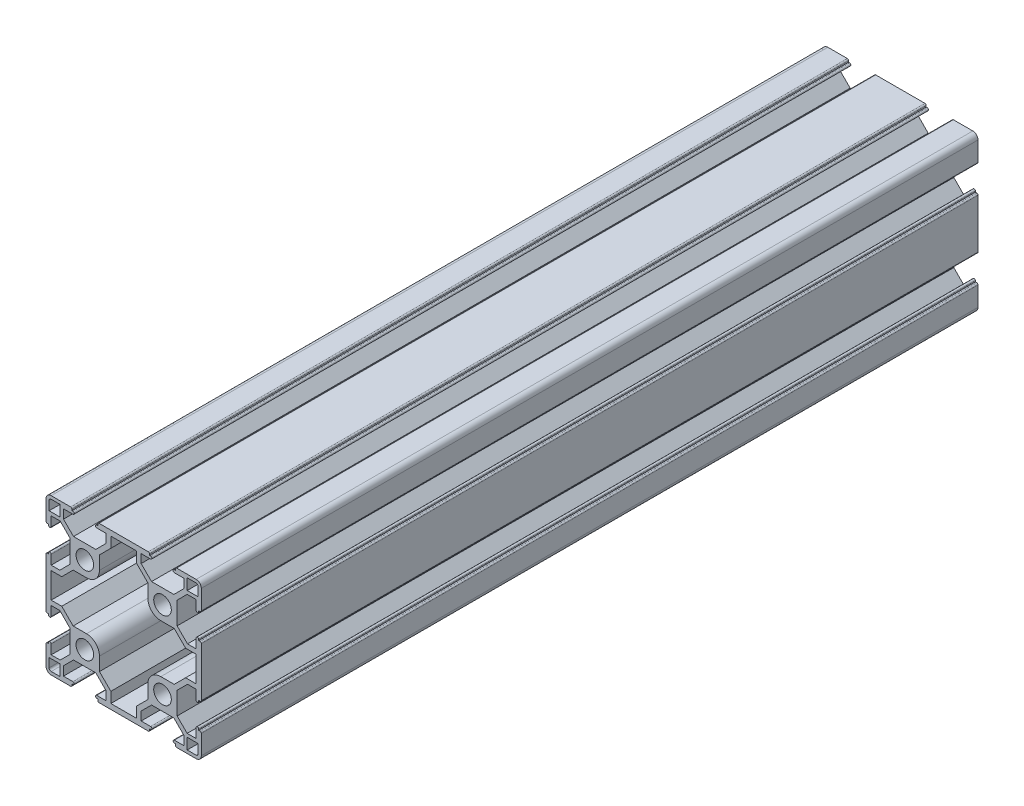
from build123d import *

# Parameters (mm, degrees)
MODEL_R         = 3.4
EXTRUDE_1_DEPTH = 300


with BuildPart() as part:
    # Model → Extrude 1 (new body)
    with BuildSketch(Plane.XY):
        with BuildLine():
            Line((27670.237038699, -9671.285265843), (27670.737038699, -9671.285265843))
            ThreePointArc((27670.737038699, -9671.285265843), (27671.09059209, -9671.138819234), (27671.237038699, -9670.785265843))
            Line((27671.237038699, -9670.785265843), (27671.237038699, -9651.785265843))
            ThreePointArc((27671.237038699, -9651.785265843), (27671.09059209, -9651.431712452), (27670.737038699, -9651.285265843))
            Line((27670.737038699, -9651.285265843), (27670.237038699, -9651.285265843))
            Line((27670.237038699, -9651.285265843), (27670.237038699, -9650.885265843))
            ThreePointArc((27670.237038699, -9650.885265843), (27670.09059209, -9650.531712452), (27669.737038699, -9650.385265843))
            ThreePointArc((27669.737038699, -9650.385265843), (27669.383485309, -9650.531712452), (27669.237038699, -9650.885265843))
            Line((27669.237038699, -9650.885265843), (27669.237038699, -9654.535265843))
            Line((27669.237038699, -9654.535265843), (27665.901252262, -9654.535265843))
            Line((27665.901252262, -9654.535265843), (27661.887038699, -9650.521052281))
            Line((27661.887038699, -9650.521052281), (27661.887038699, -9641.908058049))
            Line((27661.887038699, -9641.908058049), (27665.759830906, -9638.035265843))
            Line((27665.759830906, -9638.035265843), (27669.237038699, -9638.035265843))
            Line((27669.237038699, -9638.035265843), (27669.237038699, -9641.685265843))
            ThreePointArc((27669.237038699, -9641.685265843), (27669.383485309, -9642.038819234), (27669.737038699, -9642.185265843))
            ThreePointArc((27669.737038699, -9642.185265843), (27670.09059209, -9642.038819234), (27670.237038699, -9641.685265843))
            Line((27670.237038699, -9641.685265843), (27670.237038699, -9641.285265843))
            Line((27670.237038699, -9641.285265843), (27670.737038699, -9641.285265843))
            ThreePointArc((27670.737038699, -9641.285265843), (27671.09059209, -9641.138819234), (27671.237038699, -9640.785265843))
            Line((27671.237038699, -9640.785265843), (27671.237038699, -9633.285265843))
            ThreePointArc((27671.237038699, -9633.285265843), (27670.651252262, -9631.871052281), (27669.237038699, -9631.285265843))
            Line((27669.237038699, -9631.285265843), (27661.737038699, -9631.285265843))
            ThreePointArc((27661.737038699, -9631.285265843), (27661.383485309, -9631.431712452), (27661.237038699, -9631.785265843))
            Line((27661.237038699, -9631.785265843), (27661.237038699, -9632.285265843))
            Line((27661.237038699, -9632.285265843), (27660.837038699, -9632.285265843))
            ThreePointArc((27660.837038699, -9632.285265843), (27660.483485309, -9632.431712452), (27660.337038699, -9632.785265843))
            ThreePointArc((27660.337038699, -9632.785265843), (27660.483485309, -9633.138819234), (27660.837038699, -9633.285265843))
            Line((27660.837038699, -9633.285265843), (27664.487038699, -9633.285265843))
            Line((27664.487038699, -9633.285265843), (27664.487038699, -9636.762473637))
            Line((27664.487038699, -9636.762473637), (27660.614246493, -9640.635265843))
            Line((27660.614246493, -9640.635265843), (27652.001252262, -9640.635265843))
            Line((27652.001252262, -9640.635265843), (27647.987038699, -9636.621052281))
            Line((27647.987038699, -9636.621052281), (27647.987038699, -9633.285265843))
            Line((27647.987038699, -9633.285265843), (27651.637038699, -9633.285265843))
            ThreePointArc((27651.637038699, -9633.285265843), (27651.99059209, -9633.138819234), (27652.137038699, -9632.785265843))
            ThreePointArc((27652.137038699, -9632.785265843), (27651.99059209, -9632.431712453), (27651.637038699, -9632.285265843))
            Line((27651.637038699, -9632.285265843), (27651.237038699, -9632.285265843))
            Line((27651.237038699, -9632.285265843), (27651.237038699, -9631.785265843))
            ThreePointArc((27651.237038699, -9631.785265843), (27651.09059209, -9631.431712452), (27650.737038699, -9631.285265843))
            Line((27650.737038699, -9631.285265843), (27631.737038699, -9631.285265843))
            ThreePointArc((27631.737038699, -9631.285265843), (27631.383485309, -9631.431712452), (27631.237038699, -9631.785265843))
            Line((27631.237038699, -9631.785265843), (27631.237038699, -9632.285265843))
            Line((27631.237038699, -9632.285265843), (27630.837038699, -9632.285265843))
            ThreePointArc((27630.837038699, -9632.285265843), (27630.483485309, -9632.431712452), (27630.337038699, -9632.785265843))
            ThreePointArc((27630.337038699, -9632.785265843), (27630.483485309, -9633.138819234), (27630.837038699, -9633.285265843))
            Line((27630.837038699, -9633.285265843), (27634.487038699, -9633.285265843))
            Line((27634.487038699, -9633.285265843), (27634.487038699, -9636.621052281))
            Line((27634.487038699, -9636.621052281), (27630.472825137, -9640.635265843))
            Line((27630.472825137, -9640.635265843), (27621.859830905, -9640.635265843))
            Line((27621.859830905, -9640.635265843), (27617.987038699, -9636.762473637))
            Line((27617.987038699, -9636.762473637), (27617.987038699, -9633.285265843))
            Line((27617.987038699, -9633.285265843), (27621.637038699, -9633.285265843))
            ThreePointArc((27621.637038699, -9633.285265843), (27621.99059209, -9633.138819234), (27622.137038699, -9632.785265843))
            ThreePointArc((27622.137038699, -9632.785265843), (27621.99059209, -9632.431712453), (27621.637038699, -9632.285265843))
            Line((27621.637038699, -9632.285265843), (27621.237038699, -9632.285265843))
            Line((27621.237038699, -9632.285265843), (27621.237038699, -9631.785265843))
            ThreePointArc((27621.237038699, -9631.785265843), (27621.09059209, -9631.431712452), (27620.737038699, -9631.285265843))
            Line((27620.737038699, -9631.285265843), (27613.237038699, -9631.285265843))
            ThreePointArc((27613.237038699, -9631.285265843), (27611.822825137, -9631.871052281), (27611.237038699, -9633.285265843))
            Line((27611.237038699, -9633.285265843), (27611.237038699, -9640.785265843))
            ThreePointArc((27611.237038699, -9640.785265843), (27611.383485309, -9641.138819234), (27611.737038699, -9641.285265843))
            Line((27611.737038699, -9641.285265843), (27612.237038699, -9641.285265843))
            Line((27612.237038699, -9641.285265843), (27612.237038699, -9641.685265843))
            ThreePointArc((27612.237038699, -9641.685265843), (27612.383485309, -9642.038819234), (27612.737038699, -9642.185265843))
            ThreePointArc((27612.737038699, -9642.185265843), (27613.09059209, -9642.038819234), (27613.237038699, -9641.685265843))
            Line((27613.237038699, -9641.685265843), (27613.237038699, -9638.035265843))
            Line((27613.237038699, -9638.035265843), (27616.714246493, -9638.035265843))
            Line((27616.714246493, -9638.035265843), (27620.587038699, -9641.908058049))
            Line((27620.587038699, -9641.908058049), (27620.587038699, -9650.521052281))
            Line((27620.587038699, -9650.521052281), (27616.572825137, -9654.535265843))
            Line((27616.572825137, -9654.535265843), (27613.237038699, -9654.535265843))
            Line((27613.237038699, -9654.535265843), (27613.237038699, -9650.885265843))
            ThreePointArc((27613.237038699, -9650.885265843), (27613.09059209, -9650.531712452), (27612.737038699, -9650.385265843))
            ThreePointArc((27612.737038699, -9650.385265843), (27612.383485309, -9650.531712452), (27612.237038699, -9650.885265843))
            Line((27612.237038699, -9650.885265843), (27612.237038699, -9651.285265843))
            Line((27612.237038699, -9651.285265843), (27611.737038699, -9651.285265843))
            ThreePointArc((27611.737038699, -9651.285265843), (27611.383485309, -9651.431712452), (27611.237038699, -9651.785265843))
            Line((27611.237038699, -9651.785265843), (27611.237038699, -9670.785265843))
            ThreePointArc((27611.237038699, -9670.785265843), (27611.383485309, -9671.138819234), (27611.737038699, -9671.285265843))
            Line((27611.737038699, -9671.285265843), (27612.237038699, -9671.285265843))
            Line((27612.237038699, -9671.285265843), (27612.237038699, -9671.685265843))
            ThreePointArc((27612.237038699, -9671.685265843), (27612.383485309, -9672.038819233), (27612.737038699, -9672.185265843))
            ThreePointArc((27612.737038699, -9672.185265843), (27613.09059209, -9672.038819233), (27613.237038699, -9671.685265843))
            Line((27613.237038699, -9671.685265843), (27613.237038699, -9668.035265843))
            Line((27613.237038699, -9668.035265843), (27616.572825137, -9668.035265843))
            Line((27616.572825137, -9668.035265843), (27620.587038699, -9672.049479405))
            Line((27620.587038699, -9672.049479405), (27620.587038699, -9680.662473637))
            Line((27620.587038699, -9680.662473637), (27616.714246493, -9684.535265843))
            Line((27616.714246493, -9684.535265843), (27613.237038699, -9684.535265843))
            Line((27613.237038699, -9684.535265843), (27613.237038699, -9680.885265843))
            ThreePointArc((27613.237038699, -9680.885265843), (27613.09059209, -9680.531712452), (27612.737038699, -9680.385265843))
            ThreePointArc((27612.737038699, -9680.385265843), (27612.383485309, -9680.531712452), (27612.237038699, -9680.885265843))
            Line((27612.237038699, -9680.885265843), (27612.237038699, -9681.285265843))
            Line((27612.237038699, -9681.285265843), (27611.737038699, -9681.285265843))
            ThreePointArc((27611.737038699, -9681.285265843), (27611.383485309, -9681.431712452), (27611.237038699, -9681.785265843))
            Line((27611.237038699, -9681.785265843), (27611.237038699, -9689.285265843))
            ThreePointArc((27611.237038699, -9689.285265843), (27611.822825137, -9690.699479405), (27613.237038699, -9691.285265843))
            Line((27613.237038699, -9691.285265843), (27620.737038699, -9691.285265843))
            ThreePointArc((27620.737038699, -9691.285265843), (27621.09059209, -9691.138819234), (27621.237038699, -9690.785265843))
            Line((27621.237038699, -9690.785265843), (27621.237038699, -9690.285265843))
            Line((27621.237038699, -9690.285265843), (27621.637038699, -9690.285265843))
            ThreePointArc((27621.637038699, -9690.285265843), (27621.99059209, -9690.138819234), (27622.137038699, -9689.785265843))
            ThreePointArc((27622.137038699, -9689.785265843), (27621.99059209, -9689.431712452), (27621.637038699, -9689.285265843))
            Line((27621.637038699, -9689.285265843), (27617.987038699, -9689.285265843))
            Line((27617.987038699, -9689.285265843), (27617.987038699, -9685.808058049))
            Line((27617.987038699, -9685.808058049), (27621.859830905, -9681.935265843))
            Line((27621.859830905, -9681.935265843), (27630.472825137, -9681.935265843))
            Line((27630.472825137, -9681.935265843), (27634.487038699, -9685.949479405))
            Line((27634.487038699, -9685.949479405), (27634.487038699, -9689.285265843))
            Line((27634.487038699, -9689.285265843), (27630.837038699, -9689.285265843))
            ThreePointArc((27630.837038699, -9689.285265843), (27630.483485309, -9689.431712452), (27630.337038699, -9689.785265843))
            ThreePointArc((27630.337038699, -9689.785265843), (27630.483485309, -9690.138819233), (27630.837038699, -9690.285265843))
            Line((27630.837038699, -9690.285265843), (27631.237038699, -9690.285265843))
            Line((27631.237038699, -9690.285265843), (27631.237038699, -9690.785265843))
            ThreePointArc((27631.237038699, -9690.785265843), (27631.383485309, -9691.138819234), (27631.737038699, -9691.285265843))
            Line((27631.737038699, -9691.285265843), (27650.737038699, -9691.285265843))
            ThreePointArc((27650.737038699, -9691.285265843), (27651.09059209, -9691.138819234), (27651.237038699, -9690.785265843))
            Line((27651.237038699, -9690.785265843), (27651.237038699, -9690.285265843))
            Line((27651.237038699, -9690.285265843), (27651.637038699, -9690.285265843))
            ThreePointArc((27651.637038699, -9690.285265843), (27651.99059209, -9690.138819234), (27652.137038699, -9689.785265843))
            ThreePointArc((27652.137038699, -9689.785265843), (27651.99059209, -9689.431712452), (27651.637038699, -9689.285265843))
            Line((27651.637038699, -9689.285265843), (27647.987038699, -9689.285265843))
            Line((27647.987038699, -9689.285265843), (27647.987038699, -9685.949479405))
            Line((27647.987038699, -9685.949479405), (27652.001252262, -9681.935265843))
            Line((27652.001252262, -9681.935265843), (27660.614246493, -9681.935265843))
            Line((27660.614246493, -9681.935265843), (27664.487038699, -9685.808058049))
            Line((27664.487038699, -9685.808058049), (27664.487038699, -9689.285265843))
            Line((27664.487038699, -9689.285265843), (27660.837038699, -9689.285265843))
            ThreePointArc((27660.837038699, -9689.285265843), (27660.483485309, -9689.431712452), (27660.337038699, -9689.785265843))
            ThreePointArc((27660.337038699, -9689.785265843), (27660.483485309, -9690.138819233), (27660.837038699, -9690.285265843))
            Line((27660.837038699, -9690.285265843), (27661.237038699, -9690.285265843))
            Line((27661.237038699, -9690.285265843), (27661.237038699, -9690.785265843))
            ThreePointArc((27661.237038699, -9690.785265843), (27661.383485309, -9691.138819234), (27661.737038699, -9691.285265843))
            Line((27661.737038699, -9691.285265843), (27669.237038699, -9691.285265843))
            ThreePointArc((27669.237038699, -9691.285265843), (27670.651252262, -9690.699479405), (27671.237038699, -9689.285265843))
            Line((27671.237038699, -9689.285265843), (27671.237038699, -9681.785265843))
            ThreePointArc((27671.237038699, -9681.785265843), (27671.09059209, -9681.431712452), (27670.737038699, -9681.285265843))
            Line((27670.737038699, -9681.285265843), (27670.237038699, -9681.285265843))
            Line((27670.237038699, -9681.285265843), (27670.237038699, -9680.885265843))
            ThreePointArc((27670.237038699, -9680.885265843), (27670.09059209, -9680.531712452), (27669.737038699, -9680.385265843))
            ThreePointArc((27669.737038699, -9680.385265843), (27669.383485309, -9680.531712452), (27669.237038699, -9680.885265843))
            Line((27669.237038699, -9680.885265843), (27669.237038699, -9684.535265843))
            Line((27669.237038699, -9684.535265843), (27665.759830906, -9684.535265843))
            Line((27665.759830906, -9684.535265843), (27661.887038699, -9680.662473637))
            Line((27661.887038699, -9680.662473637), (27661.887038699, -9672.049479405))
            Line((27661.887038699, -9672.049479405), (27665.901252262, -9668.035265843))
            Line((27665.901252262, -9668.035265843), (27669.237038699, -9668.035265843))
            Line((27669.237038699, -9668.035265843), (27669.237038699, -9671.685265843))
            ThreePointArc((27669.237038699, -9671.685265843), (27669.383485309, -9672.038819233), (27669.737038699, -9672.185265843))
            ThreePointArc((27669.737038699, -9672.185265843), (27670.09059209, -9672.038819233), (27670.237038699, -9671.685265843))
            Line((27670.237038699, -9671.685265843), (27670.237038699, -9671.285265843))
        make_face()
        with Locations((27656.237038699, -9646.285265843)):
            Circle(MODEL_R, mode=Mode.SUBTRACT)
        with Locations((27656.237038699, -9676.285265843)):
            Circle(MODEL_R, mode=Mode.SUBTRACT)
        with Locations((27626.237038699, -9676.285265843)):
            Circle(MODEL_R, mode=Mode.SUBTRACT)
        with Locations((27626.237038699, -9646.285265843)):
            Circle(MODEL_R, mode=Mode.SUBTRACT)
        with BuildLine():
            Line((27670.037038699, -9636.735265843), (27665.787038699, -9636.735265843))
            Line((27665.787038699, -9636.735265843), (27665.787038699, -9632.485265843))
            Line((27665.787038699, -9632.485265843), (27669.237038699, -9632.485265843))
            ThreePointArc((27669.237038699, -9632.485265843), (27669.802724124, -9632.719580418), (27670.037038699, -9633.285265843))
            Line((27670.037038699, -9633.285265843), (27670.037038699, -9636.735265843))
        make_face(mode=Mode.SUBTRACT)
        with BuildLine():
            Line((27665.787038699, -9685.835265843), (27670.037038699, -9685.835265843))
            Line((27670.037038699, -9685.835265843), (27670.037038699, -9689.285265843))
            ThreePointArc((27670.037038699, -9689.285265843), (27669.802724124, -9689.850951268), (27669.237038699, -9690.085265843))
            Line((27669.237038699, -9690.085265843), (27665.787038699, -9690.085265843))
            Line((27665.787038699, -9690.085265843), (27665.787038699, -9685.835265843))
        make_face(mode=Mode.SUBTRACT)
        with BuildLine():
            Line((27669.237038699, -9656.335265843), (27669.237038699, -9666.235265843))
            Line((27669.237038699, -9666.235265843), (27665.155667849, -9666.235265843))
            Line((27665.155667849, -9666.235265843), (27660.755667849, -9670.635265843))
            Line((27660.755667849, -9670.635265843), (27655.587038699, -9670.635265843))
            ThreePointArc((27655.587038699, -9670.635265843), (27652.051504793, -9672.099731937), (27650.587038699, -9675.635265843))
            Line((27650.587038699, -9675.635265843), (27650.587038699, -9680.803894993))
            Line((27650.587038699, -9680.803894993), (27646.187038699, -9685.203894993))
            Line((27646.187038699, -9685.203894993), (27646.187038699, -9689.285265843))
            Line((27646.187038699, -9689.285265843), (27636.287038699, -9689.285265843))
            Line((27636.287038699, -9689.285265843), (27636.287038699, -9685.203894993))
            Line((27636.287038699, -9685.203894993), (27631.887038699, -9680.803894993))
            Line((27631.887038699, -9680.803894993), (27631.887038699, -9675.635265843))
            ThreePointArc((27631.887038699, -9675.635265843), (27630.422572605, -9672.099731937), (27626.887038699, -9670.635265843))
            Line((27626.887038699, -9670.635265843), (27621.718409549, -9670.635265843))
            Line((27621.718409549, -9670.635265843), (27617.318409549, -9666.235265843))
            Line((27617.318409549, -9666.235265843), (27613.237038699, -9666.235265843))
            Line((27613.237038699, -9666.235265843), (27613.237038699, -9656.335265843))
            Line((27613.237038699, -9656.335265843), (27617.318409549, -9656.335265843))
            Line((27617.318409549, -9656.335265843), (27621.718409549, -9651.935265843))
            Line((27621.718409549, -9651.935265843), (27626.887038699, -9651.935265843))
            ThreePointArc((27626.887038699, -9651.935265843), (27630.422572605, -9650.470799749), (27631.887038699, -9646.935265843))
            Line((27631.887038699, -9646.935265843), (27631.887038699, -9641.766636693))
            Line((27631.887038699, -9641.766636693), (27636.287038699, -9637.366636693))
            Line((27636.287038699, -9637.366636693), (27636.287038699, -9633.285265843))
            Line((27636.287038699, -9633.285265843), (27646.187038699, -9633.285265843))
            Line((27646.187038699, -9633.285265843), (27646.187038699, -9637.366636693))
            Line((27646.187038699, -9637.366636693), (27650.587038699, -9641.766636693))
            Line((27650.587038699, -9641.766636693), (27650.587038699, -9646.935265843))
            ThreePointArc((27650.587038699, -9646.935265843), (27652.051504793, -9650.470799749), (27655.587038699, -9651.935265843))
            Line((27655.587038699, -9651.935265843), (27660.755667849, -9651.935265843))
            Line((27660.755667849, -9651.935265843), (27665.155667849, -9656.335265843))
            Line((27665.155667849, -9656.335265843), (27669.237038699, -9656.335265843))
        make_face(mode=Mode.SUBTRACT)
        with BuildLine():
            Line((27612.437038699, -9685.835265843), (27616.687038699, -9685.835265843))
            Line((27616.687038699, -9685.835265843), (27616.687038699, -9690.085265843))
            Line((27616.687038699, -9690.085265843), (27613.237038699, -9690.085265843))
            ThreePointArc((27613.237038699, -9690.085265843), (27612.671353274, -9689.850951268), (27612.437038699, -9689.285265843))
            Line((27612.437038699, -9689.285265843), (27612.437038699, -9685.835265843))
        make_face(mode=Mode.SUBTRACT)
        with BuildLine():
            Line((27616.687038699, -9636.735265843), (27612.437038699, -9636.735265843))
            Line((27612.437038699, -9636.735265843), (27612.437038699, -9633.285265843))
            ThreePointArc((27612.437038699, -9633.285265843), (27612.671353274, -9632.719580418), (27613.237038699, -9632.485265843))
            Line((27613.237038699, -9632.485265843), (27616.687038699, -9632.485265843))
            Line((27616.687038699, -9632.485265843), (27616.687038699, -9636.735265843))
        make_face(mode=Mode.SUBTRACT)
    extrude(amount=EXTRUDE_1_DEPTH)


solid = part.part
